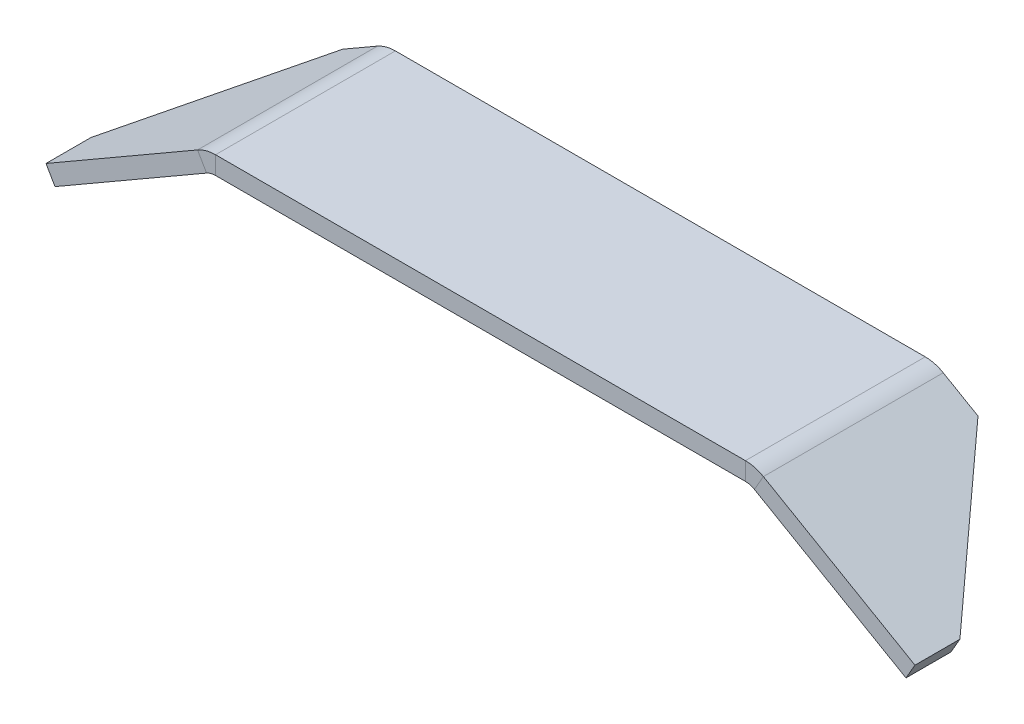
ISO-10303-21;
HEADER;
FILE_DESCRIPTION(('STEP AP214'),'2;1');
FILE_NAME('part.step','',(''),(''),'','','');
FILE_SCHEMA(('AUTOMOTIVE_DESIGN { 1 0 10303 214 1 1 1 1 }'));
ENDSEC;
DATA;
#1=APPLICATION_CONTEXT('core data for automotive mechanical design processes');
#2=APPLICATION_PROTOCOL_DEFINITION('international standard','automotive_design',2000,#1);
#3=PRODUCT_CONTEXT('',#1,'mechanical');
#4=PRODUCT('Part','Part','',(#3));
#5=PRODUCT_RELATED_PRODUCT_CATEGORY('part','',(#4));
#6=PRODUCT_DEFINITION_FORMATION('','',#4);
#7=PRODUCT_DEFINITION_CONTEXT('part definition',#1,'design');
#8=PRODUCT_DEFINITION('design','',#6,#7);
#9=PRODUCT_DEFINITION_SHAPE('','',#8);
#10=(LENGTH_UNIT() NAMED_UNIT(*) SI_UNIT(.MILLI.,.METRE.));
#11=(NAMED_UNIT(*) PLANE_ANGLE_UNIT() SI_UNIT($,.RADIAN.));
#12=(NAMED_UNIT(*) SI_UNIT($,.STERADIAN.) SOLID_ANGLE_UNIT());
#13=UNCERTAINTY_MEASURE_WITH_UNIT(LENGTH_MEASURE(1.E-05),#10,'distance_accuracy_value','');
#14=(GEOMETRIC_REPRESENTATION_CONTEXT(3) GLOBAL_UNCERTAINTY_ASSIGNED_CONTEXT((#13)) GLOBAL_UNIT_ASSIGNED_CONTEXT((#10,
#11,#12)) REPRESENTATION_CONTEXT('',''));
#15=CARTESIAN_POINT('',(0.,0.,0.));
#16=DIRECTION('',(0.,0.,1.));
#17=DIRECTION('',(1.,0.,0.));
#18=AXIS2_PLACEMENT_3D('',#15,#16,#17);
#19=CARTESIAN_POINT('',(307.138438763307,48.0000000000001,-80.0000000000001));
#20=DIRECTION('',(0.,0.,-1.));
#21=DIRECTION('',(-1.,0.,0.));
#22=AXIS2_PLACEMENT_3D('',#19,#20,#21);
#23=PLANE('',#22);
#24=DIRECTION('',(0.866025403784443,-0.500000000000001,0.));
#25=VECTOR('',#24,1.);
#26=CARTESIAN_POINT('',(313.282032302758,46.9282032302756,-80.0000000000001));
#27=LINE('',#26,#25);
#28=CARTESIAN_POINT('',(315.138438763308,45.8564064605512,-80.0000000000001));
#29=VERTEX_POINT('',#28);
#30=CARTESIAN_POINT('',(330.602540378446,36.9282032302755,-80.0000000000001));
#31=VERTEX_POINT('',#30);
#32=EDGE_CURVE('E236',#29,#31,#27,.T.);
#33=ORIENTED_EDGE('',*,*,#32,.T.);
#34=DIRECTION('',(-0.500000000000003,-0.866025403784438,0.));
#35=VECTOR('',#34,1.);
#36=CARTESIAN_POINT('',(326.602540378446,29.9999999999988,-80.0000000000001));
#37=LINE('',#36,#35);
#38=CARTESIAN_POINT('',(326.602540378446,29.9999999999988,-80.0000000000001));
#39=VERTEX_POINT('',#38);
#40=EDGE_CURVE('E136',#39,#31,#37,.F.);
#41=ORIENTED_EDGE('',*,*,#40,.F.);
#42=DIRECTION('',(0.866025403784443,-0.500000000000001,0.));
#43=VECTOR('',#42,1.);
#44=CARTESIAN_POINT('',(309.282032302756,40.0000000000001,-80.0000000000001));
#45=LINE('',#44,#43);
#46=CARTESIAN_POINT('',(311.138438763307,38.9282032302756,-80.0000000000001));
#47=VERTEX_POINT('',#46);
#48=EDGE_CURVE('E146',#47,#39,#45,.T.);
#49=ORIENTED_EDGE('',*,*,#48,.F.);
#50=DIRECTION('',(0.500000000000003,0.866025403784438,0.));
#51=VECTOR('',#50,1.);
#52=CARTESIAN_POINT('',(311.138438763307,38.9282032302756,-80.0000000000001));
#53=LINE('',#52,#51);
#54=EDGE_CURVE('E169',#47,#29,#53,.T.);
#55=ORIENTED_EDGE('',*,*,#54,.T.);
#56=EDGE_LOOP('',(#33,#41,#49,#55));
#57=FACE_BOUND('',#56,.T.);
#58=ADVANCED_FACE('F31',(#57),#23,.T.);
#59=CARTESIAN_POINT('',(309.282032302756,40.0000000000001,-80.0000000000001));
#60=DIRECTION('',(-0.500000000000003,-0.866025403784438,0.));
#61=DIRECTION('',(0.866025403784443,-0.500000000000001,0.));
#62=AXIS2_PLACEMENT_3D('',#59,#60,#61);
#63=PLANE('',#62);
#64=ORIENTED_EDGE('',*,*,#48,.T.);
#65=DIRECTION('',(-0.612372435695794,0.353553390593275,-0.70710678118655));
#66=VECTOR('',#65,1.);
#67=CARTESIAN_POINT('',(317.942286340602,35.0000000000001,-90.0000000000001));
#68=LINE('',#67,#66);
#69=CARTESIAN_POINT('',(378.564064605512,0.,-20.));
#70=VERTEX_POINT('',#69);
#71=EDGE_CURVE('E131',#70,#39,#68,.T.);
#72=ORIENTED_EDGE('',*,*,#71,.F.);
#73=DIRECTION('',(0.,0.,1.));
#74=VECTOR('',#73,1.);
#75=CARTESIAN_POINT('',(378.564064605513,0.,-80.0000000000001));
#76=LINE('',#75,#74);
#77=CARTESIAN_POINT('',(378.564064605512,0.,0.));
#78=VERTEX_POINT('',#77);
#79=EDGE_CURVE('E142',#70,#78,#76,.T.);
#80=ORIENTED_EDGE('',*,*,#79,.T.);
#81=DIRECTION('',(0.866025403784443,-0.500000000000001,0.));
#82=VECTOR('',#81,1.);
#83=CARTESIAN_POINT('',(309.282032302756,40.0000000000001,0.));
#84=LINE('',#83,#82);
#85=CARTESIAN_POINT('',(311.138438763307,38.9282032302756,0.));
#86=VERTEX_POINT('',#85);
#87=EDGE_CURVE('E246',#86,#78,#84,.T.);
#88=ORIENTED_EDGE('',*,*,#87,.F.);
#89=DIRECTION('',(0.,0.,1.));
#90=VECTOR('',#89,1.);
#91=CARTESIAN_POINT('',(311.138438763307,38.9282032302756,-80.0000000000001));
#92=LINE('',#91,#90);
#93=EDGE_CURVE('E165',#47,#86,#92,.T.);
#94=ORIENTED_EDGE('',*,*,#93,.F.);
#95=EDGE_LOOP('',(#64,#72,#80,#88,#94));
#96=FACE_BOUND('',#95,.T.);
#97=ADVANCED_FACE('F140',(#96),#63,.T.);
#98=CARTESIAN_POINT('',(313.282032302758,46.9282032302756,-80.0000000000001));
#99=DIRECTION('',(-0.500000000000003,-0.866025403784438,0.));
#100=DIRECTION('',(0.866025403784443,-0.500000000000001,0.));
#101=AXIS2_PLACEMENT_3D('',#98,#99,#100);
#102=PLANE('',#101);
#103=DIRECTION('',(-0.612372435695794,0.353553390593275,-0.70710678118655));
#104=VECTOR('',#103,1.);
#105=CARTESIAN_POINT('',(321.942286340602,41.9282032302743,-90.0000000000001));
#106=LINE('',#105,#104);
#107=CARTESIAN_POINT('',(382.564064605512,6.92820323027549,-20.));
#108=VERTEX_POINT('',#107);
#109=EDGE_CURVE('E46',#108,#31,#106,.T.);
#110=ORIENTED_EDGE('',*,*,#109,.T.);
#111=ORIENTED_EDGE('',*,*,#32,.F.);
#112=DIRECTION('',(0.,0.,1.));
#113=VECTOR('',#112,1.);
#114=CARTESIAN_POINT('',(315.138438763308,45.8564064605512,-80.0000000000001));
#115=LINE('',#114,#113);
#116=CARTESIAN_POINT('',(315.138438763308,45.8564064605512,0.));
#117=VERTEX_POINT('',#116);
#118=EDGE_CURVE('E155',#29,#117,#115,.T.);
#119=ORIENTED_EDGE('',*,*,#118,.T.);
#120=DIRECTION('',(0.866025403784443,-0.500000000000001,0.));
#121=VECTOR('',#120,1.);
#122=CARTESIAN_POINT('',(313.282032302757,46.9282032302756,0.));
#123=LINE('',#122,#121);
#124=CARTESIAN_POINT('',(382.564064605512,6.92820323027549,0.));
#125=VERTEX_POINT('',#124);
#126=EDGE_CURVE('E234',#117,#125,#123,.T.);
#127=ORIENTED_EDGE('',*,*,#126,.T.);
#128=DIRECTION('',(0.,0.,1.));
#129=VECTOR('',#128,1.);
#130=CARTESIAN_POINT('',(382.564064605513,6.92820323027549,-80.0000000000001));
#131=LINE('',#130,#129);
#132=EDGE_CURVE('E152',#108,#125,#131,.T.);
#133=ORIENTED_EDGE('',*,*,#132,.F.);
#134=EDGE_LOOP('',(#110,#111,#119,#127,#133));
#135=FACE_BOUND('',#134,.T.);
#136=ADVANCED_FACE('F233',(#135),#102,.F.);
#137=CARTESIAN_POINT('',(382.564064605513,6.92820323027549,-80.0000000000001));
#138=DIRECTION('',(-0.866025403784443,0.5,0.));
#139=DIRECTION('',(-0.500000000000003,-0.866025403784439,0.));
#140=AXIS2_PLACEMENT_3D('',#137,#138,#139);
#141=PLANE('',#140);
#142=DIRECTION('',(-0.500000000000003,-0.866025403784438,0.));
#143=VECTOR('',#142,1.);
#144=CARTESIAN_POINT('',(378.564064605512,0.,-20.));
#145=LINE('',#144,#143);
#146=EDGE_CURVE('E128',#70,#108,#145,.F.);
#147=ORIENTED_EDGE('',*,*,#146,.T.);
#148=ORIENTED_EDGE('',*,*,#132,.T.);
#149=DIRECTION('',(-0.500000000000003,-0.866025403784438,0.));
#150=VECTOR('',#149,1.);
#151=CARTESIAN_POINT('',(382.564064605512,6.92820323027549,0.));
#152=LINE('',#151,#150);
#153=EDGE_CURVE('E150',#125,#78,#152,.T.);
#154=ORIENTED_EDGE('',*,*,#153,.T.);
#155=ORIENTED_EDGE('',*,*,#79,.F.);
#156=EDGE_LOOP('',(#147,#148,#154,#155));
#157=FACE_BOUND('',#156,.T.);
#158=ADVANCED_FACE('F148',(#157),#141,.F.);
#159=CARTESIAN_POINT('',(0.,0.,-80.0000000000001));
#160=DIRECTION('',(0.500000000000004,-0.866025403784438,0.));
#161=DIRECTION('',(0.866025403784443,0.500000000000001,0.));
#162=AXIS2_PLACEMENT_3D('',#159,#160,#161);
#163=PLANE('',#162);
#164=DIRECTION('',(0.,0.,1.));
#165=VECTOR('',#164,1.);
#166=CARTESIAN_POINT('',(0.,0.,-80.0000000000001));
#167=LINE('',#166,#165);
#168=CARTESIAN_POINT('',(0.,0.,-20.));
#169=VERTEX_POINT('',#168);
#170=CARTESIAN_POINT('',(0.,0.,0.));
#171=VERTEX_POINT('',#170);
#172=EDGE_CURVE('E201',#169,#171,#167,.T.);
#173=ORIENTED_EDGE('',*,*,#172,.F.);
#174=DIRECTION('',(-0.612372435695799,-0.353553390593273,0.70710678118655));
#175=VECTOR('',#174,1.);
#176=CARTESIAN_POINT('',(25.9807621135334,15.,-50.));
#177=LINE('',#176,#175);
#178=CARTESIAN_POINT('',(51.9615242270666,30.0000000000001,-80.0000000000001));
#179=VERTEX_POINT('',#178);
#180=EDGE_CURVE('E558',#179,#169,#177,.T.);
#181=ORIENTED_EDGE('',*,*,#180,.F.);
#182=DIRECTION('',(0.866025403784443,0.500000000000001,0.));
#183=VECTOR('',#182,1.);
#184=CARTESIAN_POINT('',(0.,0.,-80.0000000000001));
#185=LINE('',#184,#183);
#186=CARTESIAN_POINT('',(67.4256258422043,38.9282032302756,-80.0000000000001));
#187=VERTEX_POINT('',#186);
#188=EDGE_CURVE('E180',#179,#187,#185,.T.);
#189=ORIENTED_EDGE('',*,*,#188,.T.);
#190=DIRECTION('',(0.,0.,1.));
#191=VECTOR('',#190,1.);
#192=CARTESIAN_POINT('',(67.4256258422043,38.9282032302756,-80.0000000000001));
#193=LINE('',#192,#191);
#194=CARTESIAN_POINT('',(67.4256258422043,38.9282032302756,0.));
#195=VERTEX_POINT('',#194);
#196=EDGE_CURVE('E191',#187,#195,#193,.T.);
#197=ORIENTED_EDGE('',*,*,#196,.T.);
#198=DIRECTION('',(0.866025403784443,0.500000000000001,0.));
#199=VECTOR('',#198,1.);
#200=CARTESIAN_POINT('',(0.,0.,0.));
#201=LINE('',#200,#199);
#202=EDGE_CURVE('E261',#171,#195,#201,.T.);
#203=ORIENTED_EDGE('',*,*,#202,.F.);
#204=EDGE_LOOP('',(#173,#181,#189,#197,#203));
#205=FACE_BOUND('',#204,.T.);
#206=ADVANCED_FACE('F360',(#205),#163,.T.);
#207=CARTESIAN_POINT('',(0.,0.,-80.0000000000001));
#208=DIRECTION('',(0.866025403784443,0.500000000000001,0.));
#209=DIRECTION('',(-0.500000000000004,0.866025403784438,0.));
#210=AXIS2_PLACEMENT_3D('',#207,#208,#209);
#211=PLANE('',#210);
#212=DIRECTION('',(0.500000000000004,-0.866025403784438,0.));
#213=VECTOR('',#212,1.);
#214=CARTESIAN_POINT('',(0.,0.,-20.));
#215=LINE('',#214,#213);
#216=CARTESIAN_POINT('',(-4.00000000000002,6.92820323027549,-20.));
#217=VERTEX_POINT('',#216);
#218=EDGE_CURVE('E560',#169,#217,#215,.F.);
#219=ORIENTED_EDGE('',*,*,#218,.F.);
#220=ORIENTED_EDGE('',*,*,#172,.T.);
#221=DIRECTION('',(-0.500000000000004,0.866025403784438,0.));
#222=VECTOR('',#221,1.);
#223=CARTESIAN_POINT('',(0.,0.,0.));
#224=LINE('',#223,#222);
#225=CARTESIAN_POINT('',(-4.00000000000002,6.92820323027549,0.));
#226=VERTEX_POINT('',#225);
#227=EDGE_CURVE('E258',#171,#226,#224,.T.);
#228=ORIENTED_EDGE('',*,*,#227,.T.);
#229=DIRECTION('',(0.,0.,1.));
#230=VECTOR('',#229,1.);
#231=CARTESIAN_POINT('',(-4.00000000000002,6.92820323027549,-80.0000000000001));
#232=LINE('',#231,#230);
#233=EDGE_CURVE('E217',#217,#226,#232,.T.);
#234=ORIENTED_EDGE('',*,*,#233,.F.);
#235=EDGE_LOOP('',(#219,#220,#228,#234));
#236=FACE_BOUND('',#235,.T.);
#237=ADVANCED_FACE('F349',(#236),#211,.F.);
#238=CARTESIAN_POINT('',(-4.00000000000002,6.92820323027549,-80.0000000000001));
#239=DIRECTION('',(0.500000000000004,-0.866025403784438,0.));
#240=DIRECTION('',(0.866025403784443,0.500000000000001,0.));
#241=AXIS2_PLACEMENT_3D('',#238,#239,#240);
#242=PLANE('',#241);
#243=DIRECTION('',(-0.612372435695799,-0.353553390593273,0.70710678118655));
#244=VECTOR('',#243,1.);
#245=CARTESIAN_POINT('',(21.9807621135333,21.9282032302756,-50.));
#246=LINE('',#245,#244);
#247=CARTESIAN_POINT('',(47.9615242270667,36.9282032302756,-80.0000000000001));
#248=VERTEX_POINT('',#247);
#249=EDGE_CURVE('E54',#248,#217,#246,.T.);
#250=ORIENTED_EDGE('',*,*,#249,.T.);
#251=ORIENTED_EDGE('',*,*,#233,.T.);
#252=DIRECTION('',(0.866025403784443,0.500000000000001,0.));
#253=VECTOR('',#252,1.);
#254=CARTESIAN_POINT('',(-4.00000000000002,6.92820323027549,0.));
#255=LINE('',#254,#253);
#256=CARTESIAN_POINT('',(63.4256258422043,45.8564064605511,0.));
#257=VERTEX_POINT('',#256);
#258=EDGE_CURVE('E255',#226,#257,#255,.T.);
#259=ORIENTED_EDGE('',*,*,#258,.T.);
#260=DIRECTION('',(0.,0.,1.));
#261=VECTOR('',#260,1.);
#262=CARTESIAN_POINT('',(63.4256258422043,45.8564064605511,-80.0000000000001));
#263=LINE('',#262,#261);
#264=CARTESIAN_POINT('',(63.4256258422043,45.8564064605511,-80.0000000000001));
#265=VERTEX_POINT('',#264);
#266=EDGE_CURVE('E219',#265,#257,#263,.T.);
#267=ORIENTED_EDGE('',*,*,#266,.F.);
#268=DIRECTION('',(0.866025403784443,0.500000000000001,0.));
#269=VECTOR('',#268,1.);
#270=CARTESIAN_POINT('',(-4.00000000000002,6.92820323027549,-80.0000000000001));
#271=LINE('',#270,#269);
#272=EDGE_CURVE('E182',#248,#265,#271,.T.);
#273=ORIENTED_EDGE('',*,*,#272,.F.);
#274=EDGE_LOOP('',(#250,#251,#259,#267,#273));
#275=FACE_BOUND('',#274,.T.);
#276=ADVANCED_FACE('F344',(#275),#242,.F.);
#277=CARTESIAN_POINT('',(307.138438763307,32.0000000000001,-80.0000000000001));
#278=DIRECTION('',(0.,0.,1.));
#279=DIRECTION('',(1.,0.,0.));
#280=AXIS2_PLACEMENT_3D('',#277,#278,#279);
#281=PLANE('',#280);
#282=DIRECTION('',(0.500000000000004,-0.866025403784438,0.));
#283=VECTOR('',#282,1.);
#284=CARTESIAN_POINT('',(51.9615242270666,30.0000000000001,-80.0000000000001));
#285=LINE('',#284,#283);
#286=EDGE_CURVE('E561',#179,#248,#285,.F.);
#287=ORIENTED_EDGE('',*,*,#286,.T.);
#288=ORIENTED_EDGE('',*,*,#272,.T.);
#289=DIRECTION('',(0.500000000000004,-0.866025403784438,0.));
#290=VECTOR('',#289,1.);
#291=CARTESIAN_POINT('',(63.4256258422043,45.8564064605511,-80.0000000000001));
#292=LINE('',#291,#290);
#293=EDGE_CURVE('E39',#265,#187,#292,.T.);
#294=ORIENTED_EDGE('',*,*,#293,.T.);
#295=ORIENTED_EDGE('',*,*,#188,.F.);
#296=EDGE_LOOP('',(#287,#288,#294,#295));
#297=FACE_BOUND('',#296,.T.);
#298=ADVANCED_FACE('F179',(#297),#281,.F.);
#299=CARTESIAN_POINT('',(71.4256258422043,40.0000000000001,-80.0000000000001));
#300=DIRECTION('',(0.,0.,-1.));
#301=DIRECTION('',(-1.,0.,0.));
#302=AXIS2_PLACEMENT_3D('',#299,#300,#301);
#303=PLANE('',#302);
#304=DIRECTION('',(0.,1.,0.));
#305=VECTOR('',#304,1.);
#306=CARTESIAN_POINT('',(71.4256258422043,40.0000000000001,-80.0000000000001));
#307=LINE('',#306,#305);
#308=CARTESIAN_POINT('',(71.4256258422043,40.0000000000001,-80.0000000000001));
#309=VERTEX_POINT('',#308);
#310=CARTESIAN_POINT('',(71.4256258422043,48.0000000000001,-80.0000000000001));
#311=VERTEX_POINT('',#310);
#312=EDGE_CURVE('E11',#309,#311,#307,.T.);
#313=ORIENTED_EDGE('',*,*,#312,.F.);
#314=CARTESIAN_POINT('',(71.4256258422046,32.0000000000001,-80.0000000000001));
#315=DIRECTION('',(0.,0.,1.));
#316=DIRECTION('',(1.,0.,0.));
#317=AXIS2_PLACEMENT_3D('',#314,#315,#316);
#318=CIRCLE('',#317,8.);
#319=EDGE_CURVE('E194',#187,#309,#318,.F.);
#320=ORIENTED_EDGE('',*,*,#319,.F.);
#321=ORIENTED_EDGE('',*,*,#293,.F.);
#322=CARTESIAN_POINT('',(71.4256258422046,32.0000000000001,-80.0000000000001));
#323=DIRECTION('',(0.,0.,1.));
#324=DIRECTION('',(1.,0.,0.));
#325=AXIS2_PLACEMENT_3D('',#322,#323,#324);
#326=CIRCLE('',#325,16.);
#327=EDGE_CURVE('E278',#265,#311,#326,.F.);
#328=ORIENTED_EDGE('',*,*,#327,.T.);
#329=EDGE_LOOP('',(#313,#320,#321,#328));
#330=FACE_BOUND('',#329,.T.);
#331=ADVANCED_FACE('F33',(#330),#303,.T.);
#332=CARTESIAN_POINT('',(63.4256258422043,45.8564064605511,-80.0000000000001));
#333=DIRECTION('',(0.,0.,-1.));
#334=DIRECTION('',(-1.,0.,0.));
#335=AXIS2_PLACEMENT_3D('',#332,#333,#334);
#336=PLANE('',#335);
#337=DIRECTION('',(1.,0.,0.));
#338=VECTOR('',#337,1.);
#339=CARTESIAN_POINT('',(69.2820323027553,40.0000000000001,-80.0000000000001));
#340=LINE('',#339,#338);
#341=CARTESIAN_POINT('',(307.138438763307,40.0000000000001,-80.0000000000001));
#342=VERTEX_POINT('',#341);
#343=EDGE_CURVE('E158',#309,#342,#340,.T.);
#344=ORIENTED_EDGE('',*,*,#343,.F.);
#345=ORIENTED_EDGE('',*,*,#312,.T.);
#346=DIRECTION('',(1.,0.,0.));
#347=VECTOR('',#346,1.);
#348=CARTESIAN_POINT('',(69.2820323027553,48.0000000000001,-80.0000000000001));
#349=LINE('',#348,#347);
#350=CARTESIAN_POINT('',(307.138438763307,48.0000000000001,-80.0000000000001));
#351=VERTEX_POINT('',#350);
#352=EDGE_CURVE('E275',#311,#351,#349,.T.);
#353=ORIENTED_EDGE('',*,*,#352,.T.);
#354=DIRECTION('',(0.,-1.,0.));
#355=VECTOR('',#354,1.);
#356=CARTESIAN_POINT('',(307.138438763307,48.0000000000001,-80.0000000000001));
#357=LINE('',#356,#355);
#358=EDGE_CURVE('E167',#351,#342,#357,.T.);
#359=ORIENTED_EDGE('',*,*,#358,.T.);
#360=EDGE_LOOP('',(#344,#345,#353,#359));
#361=FACE_BOUND('',#360,.T.);
#362=ADVANCED_FACE('F291',(#361),#336,.T.);
#363=CARTESIAN_POINT('',(67.4256258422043,38.9282032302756,0.));
#364=DIRECTION('',(0.,0.,1.));
#365=DIRECTION('',(1.,0.,0.));
#366=AXIS2_PLACEMENT_3D('',#363,#364,#365);
#367=PLANE('',#366);
#368=DIRECTION('',(-0.500000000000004,0.866025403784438,0.));
#369=VECTOR('',#368,1.);
#370=CARTESIAN_POINT('',(67.4256258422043,38.9282032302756,0.));
#371=LINE('',#370,#369);
#372=EDGE_CURVE('E173',#195,#257,#371,.T.);
#373=ORIENTED_EDGE('',*,*,#372,.F.);
#374=CARTESIAN_POINT('',(71.4256258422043,32.0000000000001,0.));
#375=DIRECTION('',(0.,0.,1.));
#376=DIRECTION('',(1.,0.,0.));
#377=AXIS2_PLACEMENT_3D('',#374,#375,#376);
#378=CIRCLE('',#377,8.);
#379=CARTESIAN_POINT('',(71.4256258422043,40.0000000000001,0.));
#380=VERTEX_POINT('',#379);
#381=EDGE_CURVE('E196',#195,#380,#378,.F.);
#382=ORIENTED_EDGE('',*,*,#381,.T.);
#383=DIRECTION('',(0.,-1.,0.));
#384=VECTOR('',#383,1.);
#385=CARTESIAN_POINT('',(71.4256258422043,48.0000000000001,0.));
#386=LINE('',#385,#384);
#387=CARTESIAN_POINT('',(71.4256258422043,48.0000000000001,0.));
#388=VERTEX_POINT('',#387);
#389=EDGE_CURVE('E171',#388,#380,#386,.T.);
#390=ORIENTED_EDGE('',*,*,#389,.F.);
#391=CARTESIAN_POINT('',(71.4256258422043,32.0000000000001,0.));
#392=DIRECTION('',(0.,0.,1.));
#393=DIRECTION('',(1.,0.,0.));
#394=AXIS2_PLACEMENT_3D('',#391,#392,#393);
#395=CIRCLE('',#394,16.);
#396=EDGE_CURVE('E252',#257,#388,#395,.F.);
#397=ORIENTED_EDGE('',*,*,#396,.F.);
#398=EDGE_LOOP('',(#373,#382,#390,#397));
#399=FACE_BOUND('',#398,.T.);
#400=ADVANCED_FACE('F333',(#399),#367,.T.);
#401=CARTESIAN_POINT('',(71.4256258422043,48.0000000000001,0.));
#402=DIRECTION('',(0.,0.,1.));
#403=DIRECTION('',(1.,0.,0.));
#404=AXIS2_PLACEMENT_3D('',#401,#402,#403);
#405=PLANE('',#404);
#406=ORIENTED_EDGE('',*,*,#202,.T.);
#407=ORIENTED_EDGE('',*,*,#372,.T.);
#408=ORIENTED_EDGE('',*,*,#258,.F.);
#409=ORIENTED_EDGE('',*,*,#227,.F.);
#410=EDGE_LOOP('',(#406,#407,#408,#409));
#411=FACE_BOUND('',#410,.T.);
#412=ADVANCED_FACE('F330',(#411),#405,.T.);
#413=CARTESIAN_POINT('',(311.138438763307,38.9282032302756,-80.0000000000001));
#414=DIRECTION('',(0.,0.,-1.));
#415=DIRECTION('',(-1.,0.,0.));
#416=AXIS2_PLACEMENT_3D('',#413,#414,#415);
#417=PLANE('',#416);
#418=ORIENTED_EDGE('',*,*,#54,.F.);
#419=CARTESIAN_POINT('',(307.138438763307,32.0000000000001,-80.0000000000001));
#420=DIRECTION('',(0.,0.,1.));
#421=DIRECTION('',(1.,0.,0.));
#422=AXIS2_PLACEMENT_3D('',#419,#420,#421);
#423=CIRCLE('',#422,8.);
#424=EDGE_CURVE('E153',#342,#47,#423,.F.);
#425=ORIENTED_EDGE('',*,*,#424,.F.);
#426=ORIENTED_EDGE('',*,*,#358,.F.);
#427=CARTESIAN_POINT('',(307.138438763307,32.0000000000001,-80.0000000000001));
#428=DIRECTION('',(0.,0.,1.));
#429=DIRECTION('',(1.,0.,0.));
#430=AXIS2_PLACEMENT_3D('',#427,#428,#429);
#431=CIRCLE('',#430,16.);
#432=EDGE_CURVE('E272',#351,#29,#431,.F.);
#433=ORIENTED_EDGE('',*,*,#432,.T.);
#434=EDGE_LOOP('',(#418,#425,#426,#433));
#435=FACE_BOUND('',#434,.T.);
#436=ADVANCED_FACE('F298',(#435),#417,.T.);
#437=CARTESIAN_POINT('',(307.138438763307,40.0000000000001,0.));
#438=DIRECTION('',(0.,0.,1.));
#439=DIRECTION('',(1.,0.,0.));
#440=AXIS2_PLACEMENT_3D('',#437,#438,#439);
#441=PLANE('',#440);
#442=DIRECTION('',(0.,1.,0.));
#443=VECTOR('',#442,1.);
#444=CARTESIAN_POINT('',(307.138438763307,40.0000000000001,0.));
#445=LINE('',#444,#443);
#446=CARTESIAN_POINT('',(307.138438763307,40.0000000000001,0.));
#447=VERTEX_POINT('',#446);
#448=CARTESIAN_POINT('',(307.138438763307,48.0000000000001,0.));
#449=VERTEX_POINT('',#448);
#450=EDGE_CURVE('E164',#447,#449,#445,.T.);
#451=ORIENTED_EDGE('',*,*,#450,.F.);
#452=CARTESIAN_POINT('',(307.138438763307,32.0000000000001,0.));
#453=DIRECTION('',(0.,0.,1.));
#454=DIRECTION('',(1.,0.,0.));
#455=AXIS2_PLACEMENT_3D('',#452,#453,#454);
#456=CIRCLE('',#455,8.);
#457=EDGE_CURVE('E267',#447,#86,#456,.F.);
#458=ORIENTED_EDGE('',*,*,#457,.T.);
#459=DIRECTION('',(-0.500000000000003,-0.866025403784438,0.));
#460=VECTOR('',#459,1.);
#461=CARTESIAN_POINT('',(315.138438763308,45.8564064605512,0.));
#462=LINE('',#461,#460);
#463=EDGE_CURVE('E162',#117,#86,#462,.T.);
#464=ORIENTED_EDGE('',*,*,#463,.F.);
#465=CARTESIAN_POINT('',(307.138438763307,32.0000000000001,0.));
#466=DIRECTION('',(0.,0.,1.));
#467=DIRECTION('',(1.,0.,0.));
#468=AXIS2_PLACEMENT_3D('',#465,#466,#467);
#469=CIRCLE('',#468,16.);
#470=EDGE_CURVE('E242',#449,#117,#469,.F.);
#471=ORIENTED_EDGE('',*,*,#470,.F.);
#472=EDGE_LOOP('',(#451,#458,#464,#471));
#473=FACE_BOUND('',#472,.T.);
#474=ADVANCED_FACE('F303',(#473),#441,.T.);
#475=CARTESIAN_POINT('',(315.138438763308,45.8564064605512,0.));
#476=DIRECTION('',(0.,0.,1.));
#477=DIRECTION('',(1.,0.,0.));
#478=AXIS2_PLACEMENT_3D('',#475,#476,#477);
#479=PLANE('',#478);
#480=DIRECTION('',(1.,0.,0.));
#481=VECTOR('',#480,1.);
#482=CARTESIAN_POINT('',(69.2820323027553,40.0000000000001,0.));
#483=LINE('',#482,#481);
#484=EDGE_CURVE('E264',#380,#447,#483,.T.);
#485=ORIENTED_EDGE('',*,*,#484,.T.);
#486=ORIENTED_EDGE('',*,*,#450,.T.);
#487=DIRECTION('',(1.,0.,0.));
#488=VECTOR('',#487,1.);
#489=CARTESIAN_POINT('',(69.2820323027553,48.0000000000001,0.));
#490=LINE('',#489,#488);
#491=EDGE_CURVE('E244',#388,#449,#490,.T.);
#492=ORIENTED_EDGE('',*,*,#491,.F.);
#493=ORIENTED_EDGE('',*,*,#389,.T.);
#494=EDGE_LOOP('',(#485,#486,#492,#493));
#495=FACE_BOUND('',#494,.T.);
#496=ADVANCED_FACE('F306',(#495),#479,.T.);
#497=CARTESIAN_POINT('',(307.138438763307,32.0000000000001,-80.0000000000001));
#498=DIRECTION('',(0.,0.,1.));
#499=DIRECTION('',(1.,0.,0.));
#500=AXIS2_PLACEMENT_3D('',#497,#498,#499);
#501=CYLINDRICAL_SURFACE('',#500,8.);
#502=ORIENTED_EDGE('',*,*,#457,.F.);
#503=DIRECTION('',(0.,0.,1.));
#504=VECTOR('',#503,1.);
#505=CARTESIAN_POINT('',(307.138438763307,40.0000000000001,-80.0000000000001));
#506=LINE('',#505,#504);
#507=EDGE_CURVE('E212',#342,#447,#506,.T.);
#508=ORIENTED_EDGE('',*,*,#507,.F.);
#509=ORIENTED_EDGE('',*,*,#424,.T.);
#510=ORIENTED_EDGE('',*,*,#93,.T.);
#511=EDGE_LOOP('',(#502,#508,#509,#510));
#512=FACE_BOUND('',#511,.T.);
#513=ADVANCED_FACE('F301',(#512),#501,.F.);
#514=CARTESIAN_POINT('',(69.2820323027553,40.0000000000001,-80.0000000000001));
#515=DIRECTION('',(0.,-1.,0.));
#516=DIRECTION('',(1.,0.,0.));
#517=AXIS2_PLACEMENT_3D('',#514,#515,#516);
#518=PLANE('',#517);
#519=ORIENTED_EDGE('',*,*,#484,.F.);
#520=DIRECTION('',(0.,0.,1.));
#521=VECTOR('',#520,1.);
#522=CARTESIAN_POINT('',(71.4256258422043,40.0000000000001,-80.0000000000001));
#523=LINE('',#522,#521);
#524=EDGE_CURVE('E200',#309,#380,#523,.T.);
#525=ORIENTED_EDGE('',*,*,#524,.F.);
#526=ORIENTED_EDGE('',*,*,#343,.T.);
#527=ORIENTED_EDGE('',*,*,#507,.T.);
#528=EDGE_LOOP('',(#519,#525,#526,#527));
#529=FACE_BOUND('',#528,.T.);
#530=ADVANCED_FACE('F296',(#529),#518,.T.);
#531=CARTESIAN_POINT('',(71.4256258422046,32.0000000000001,-80.0000000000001));
#532=DIRECTION('',(0.,0.,1.));
#533=DIRECTION('',(1.,0.,0.));
#534=AXIS2_PLACEMENT_3D('',#531,#532,#533);
#535=CYLINDRICAL_SURFACE('',#534,8.);
#536=ORIENTED_EDGE('',*,*,#381,.F.);
#537=ORIENTED_EDGE('',*,*,#196,.F.);
#538=ORIENTED_EDGE('',*,*,#319,.T.);
#539=ORIENTED_EDGE('',*,*,#524,.T.);
#540=EDGE_LOOP('',(#536,#537,#538,#539));
#541=FACE_BOUND('',#540,.T.);
#542=ADVANCED_FACE('F192',(#541),#535,.F.);
#543=CARTESIAN_POINT('',(71.4256258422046,32.0000000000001,-80.0000000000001));
#544=DIRECTION('',(0.,0.,1.));
#545=DIRECTION('',(1.,0.,0.));
#546=AXIS2_PLACEMENT_3D('',#543,#544,#545);
#547=CYLINDRICAL_SURFACE('',#546,16.);
#548=ORIENTED_EDGE('',*,*,#396,.T.);
#549=DIRECTION('',(0.,0.,1.));
#550=VECTOR('',#549,1.);
#551=CARTESIAN_POINT('',(71.4256258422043,48.0000000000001,-80.0000000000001));
#552=LINE('',#551,#550);
#553=EDGE_CURVE('E222',#311,#388,#552,.T.);
#554=ORIENTED_EDGE('',*,*,#553,.F.);
#555=ORIENTED_EDGE('',*,*,#327,.F.);
#556=ORIENTED_EDGE('',*,*,#266,.T.);
#557=EDGE_LOOP('',(#548,#554,#555,#556));
#558=FACE_BOUND('',#557,.T.);
#559=ADVANCED_FACE('F283',(#558),#547,.T.);
#560=CARTESIAN_POINT('',(69.2820323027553,48.0000000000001,-80.0000000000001));
#561=DIRECTION('',(0.,-1.,0.));
#562=DIRECTION('',(1.,0.,0.));
#563=AXIS2_PLACEMENT_3D('',#560,#561,#562);
#564=PLANE('',#563);
#565=ORIENTED_EDGE('',*,*,#491,.T.);
#566=DIRECTION('',(0.,0.,1.));
#567=VECTOR('',#566,1.);
#568=CARTESIAN_POINT('',(307.138438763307,48.0000000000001,-80.0000000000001));
#569=LINE('',#568,#567);
#570=EDGE_CURVE('E225',#351,#449,#569,.T.);
#571=ORIENTED_EDGE('',*,*,#570,.F.);
#572=ORIENTED_EDGE('',*,*,#352,.F.);
#573=ORIENTED_EDGE('',*,*,#553,.T.);
#574=EDGE_LOOP('',(#565,#571,#572,#573));
#575=FACE_BOUND('',#574,.T.);
#576=ADVANCED_FACE('F288',(#575),#564,.F.);
#577=CARTESIAN_POINT('',(307.138438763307,32.0000000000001,-80.0000000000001));
#578=DIRECTION('',(0.,0.,1.));
#579=DIRECTION('',(1.,0.,0.));
#580=AXIS2_PLACEMENT_3D('',#577,#578,#579);
#581=CYLINDRICAL_SURFACE('',#580,16.);
#582=ORIENTED_EDGE('',*,*,#470,.T.);
#583=ORIENTED_EDGE('',*,*,#118,.F.);
#584=ORIENTED_EDGE('',*,*,#432,.F.);
#585=ORIENTED_EDGE('',*,*,#570,.T.);
#586=EDGE_LOOP('',(#582,#583,#584,#585));
#587=FACE_BOUND('',#586,.T.);
#588=ADVANCED_FACE('F307',(#587),#581,.T.);
#589=CARTESIAN_POINT('',(307.138438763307,32.0000000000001,0.));
#590=DIRECTION('',(0.,0.,1.));
#591=DIRECTION('',(1.,0.,0.));
#592=AXIS2_PLACEMENT_3D('',#589,#590,#591);
#593=PLANE('',#592);
#594=ORIENTED_EDGE('',*,*,#87,.T.);
#595=ORIENTED_EDGE('',*,*,#153,.F.);
#596=ORIENTED_EDGE('',*,*,#126,.F.);
#597=ORIENTED_EDGE('',*,*,#463,.T.);
#598=EDGE_LOOP('',(#594,#595,#596,#597));
#599=FACE_BOUND('',#598,.T.);
#600=ADVANCED_FACE('F241',(#599),#593,.T.);
#601=CARTESIAN_POINT('',(25.9807621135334,15.,-50.));
#602=DIRECTION('',(0.612372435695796,0.353553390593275,0.70710678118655));
#603=DIRECTION('',(-0.612372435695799,-0.353553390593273,0.70710678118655));
#604=AXIS2_PLACEMENT_3D('',#601,#602,#603);
#605=PLANE('',#604);
#606=ORIENTED_EDGE('',*,*,#180,.T.);
#607=ORIENTED_EDGE('',*,*,#218,.T.);
#608=ORIENTED_EDGE('',*,*,#249,.F.);
#609=ORIENTED_EDGE('',*,*,#286,.F.);
#610=EDGE_LOOP('',(#606,#607,#608,#609));
#611=FACE_BOUND('',#610,.T.);
#612=ADVANCED_FACE('F314',(#611),#605,.F.);
#613=CARTESIAN_POINT('',(317.942286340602,35.0000000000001,-90.0000000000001));
#614=DIRECTION('',(-0.612372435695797,0.353553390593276,0.70710678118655));
#615=DIRECTION('',(-0.612372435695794,0.353553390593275,-0.70710678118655));
#616=AXIS2_PLACEMENT_3D('',#613,#614,#615);
#617=PLANE('',#616);
#618=ORIENTED_EDGE('',*,*,#71,.T.);
#619=ORIENTED_EDGE('',*,*,#40,.T.);
#620=ORIENTED_EDGE('',*,*,#109,.F.);
#621=ORIENTED_EDGE('',*,*,#146,.F.);
#622=EDGE_LOOP('',(#618,#619,#620,#621));
#623=FACE_BOUND('',#622,.T.);
#624=ADVANCED_FACE('F130',(#623),#617,.F.);
#625=CLOSED_SHELL('',(#58,#97,#136,#158,#206,#237,#276,#298,#331,#362,#400,#412,#436,#474,#496,
#513,#530,#542,#559,#576,#588,#600,#612,#624));
#626=MANIFOLD_SOLID_BREP('B2',#625);
#627=ADVANCED_BREP_SHAPE_REPRESENTATION('',(#18,#626),#14);
#628=SHAPE_DEFINITION_REPRESENTATION(#9,#627);
ENDSEC;
END-ISO-10303-21;
